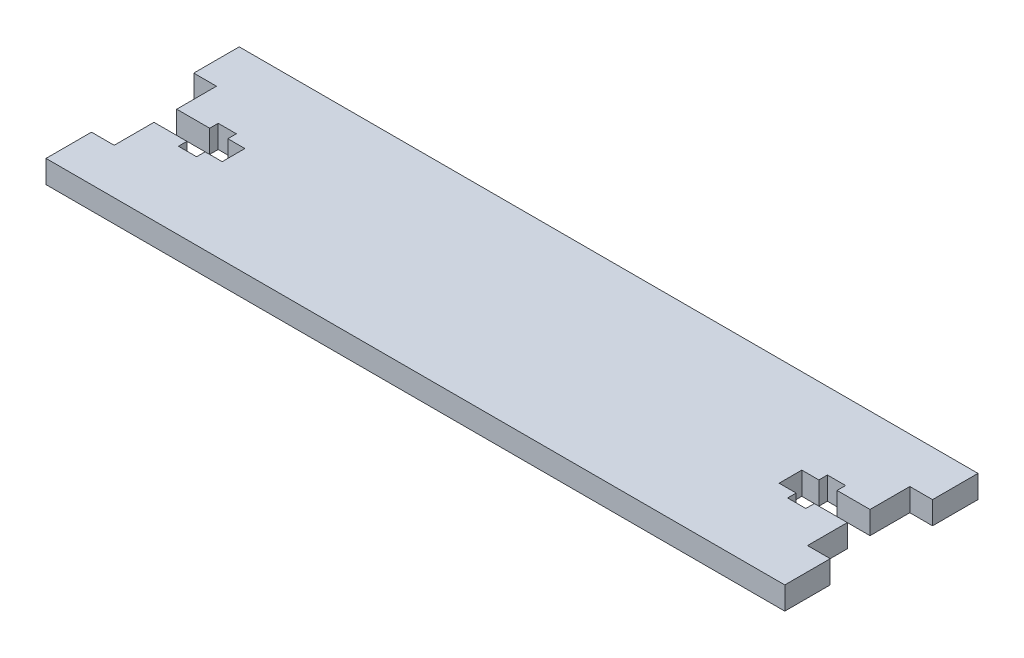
from build123d import *

# Parameters (mm, degrees)
AUFSATZ_LINEAR_AUSTRAGEN1_DEPTH = 4


with BuildPart() as part:
    # Skizze2 → Aufsatz-Linear austragen1 (new body)
    with BuildSketch(Plane(origin=(0, 0, 0), x_dir=(1, 0, 0), z_dir=(0, 1, 0))):
        Polygon((-61, 9), (-61, 2), (-55.2, 2), (-55.2, 3.5), (-52, 3.5), (-52, 2), (-49, 2), (-49, -2), (-52, -2), (-52, -3.5), (-55.2, -3.5), (-55.2, -2), (-61, -2), (-61, -9), (-65, -9), (-65, -17), (65, -17), (65, -9), (61, -9), (61, -2), (55.2, -2), (55.2, -3.5), (52, -3.5), (52, -2), (49, -2), (49, 2), (52, 2), (52, 3.5), (55.2, 3.5), (55.2, 2), (61, 2), (61, 9), (65, 9), (65, 17), (-65, 17), (-65, 9), align=None)
    extrude(amount=AUFSATZ_LINEAR_AUSTRAGEN1_DEPTH)


solid = part.part
